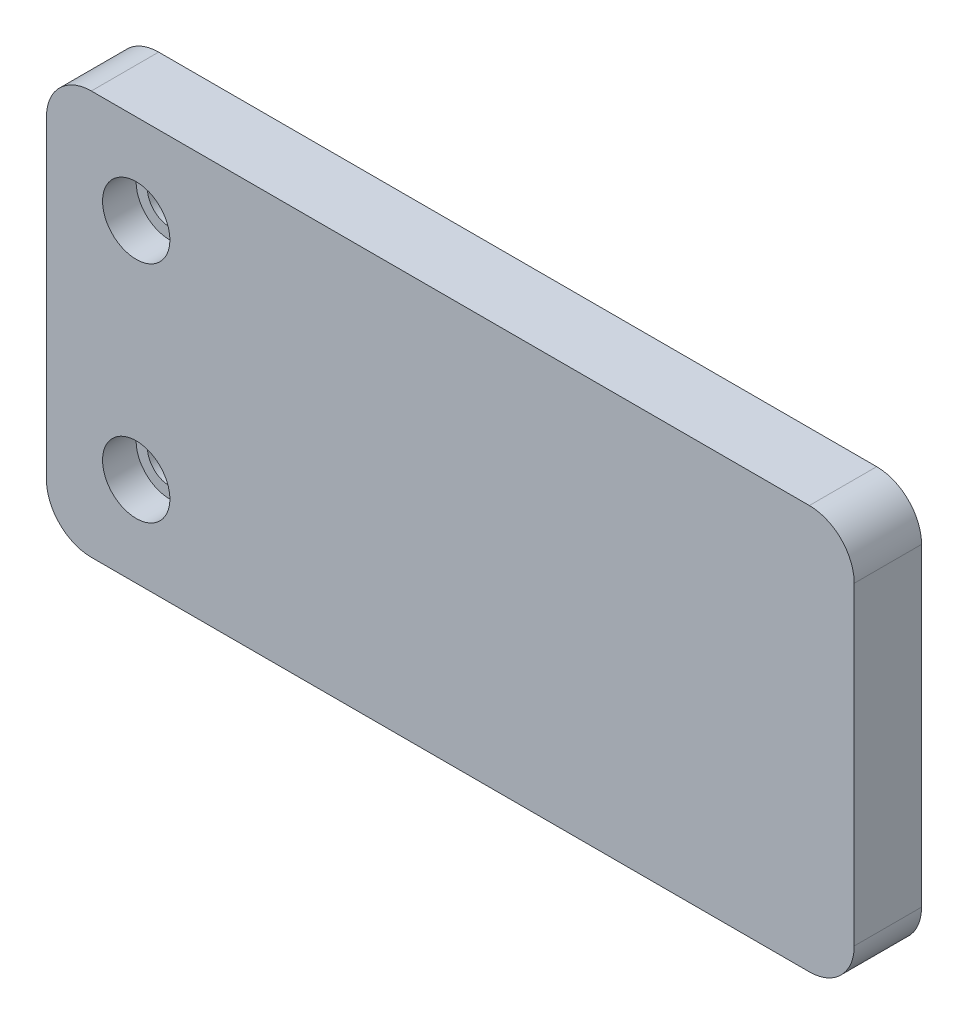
ISO-10303-21;
HEADER;
FILE_DESCRIPTION(('STEP AP214'),'2;1');
FILE_NAME('part.step','',(''),(''),'','','');
FILE_SCHEMA(('AUTOMOTIVE_DESIGN { 1 0 10303 214 1 1 1 1 }'));
ENDSEC;
DATA;
#1=APPLICATION_CONTEXT('core data for automotive mechanical design processes');
#2=APPLICATION_PROTOCOL_DEFINITION('international standard','automotive_design',2000,#1);
#3=PRODUCT_CONTEXT('',#1,'mechanical');
#4=PRODUCT('Part','Part','',(#3));
#5=PRODUCT_RELATED_PRODUCT_CATEGORY('part','',(#4));
#6=PRODUCT_DEFINITION_FORMATION('','',#4);
#7=PRODUCT_DEFINITION_CONTEXT('part definition',#1,'design');
#8=PRODUCT_DEFINITION('design','',#6,#7);
#9=PRODUCT_DEFINITION_SHAPE('','',#8);
#10=(LENGTH_UNIT() NAMED_UNIT(*) SI_UNIT(.MILLI.,.METRE.));
#11=(NAMED_UNIT(*) PLANE_ANGLE_UNIT() SI_UNIT($,.RADIAN.));
#12=(NAMED_UNIT(*) SI_UNIT($,.STERADIAN.) SOLID_ANGLE_UNIT());
#13=UNCERTAINTY_MEASURE_WITH_UNIT(LENGTH_MEASURE(1.E-05),#10,'distance_accuracy_value','');
#14=(GEOMETRIC_REPRESENTATION_CONTEXT(3) GLOBAL_UNCERTAINTY_ASSIGNED_CONTEXT((#13)) GLOBAL_UNIT_ASSIGNED_CONTEXT((#10,
#11,#12)) REPRESENTATION_CONTEXT('',''));
#15=CARTESIAN_POINT('',(0.,0.,0.));
#16=DIRECTION('',(0.,0.,1.));
#17=DIRECTION('',(1.,0.,0.));
#18=AXIS2_PLACEMENT_3D('',#15,#16,#17);
#19=CARTESIAN_POINT('',(0.,0.,9.525));
#20=DIRECTION('',(0.,0.,1.));
#21=DIRECTION('',(1.,0.,0.));
#22=AXIS2_PLACEMENT_3D('',#19,#20,#21);
#23=PLANE('',#22);
#24=CARTESIAN_POINT('',(12.7,44.45,9.525));
#25=DIRECTION('',(0.,0.,1.));
#26=DIRECTION('',(1.,0.,0.));
#27=AXIS2_PLACEMENT_3D('',#24,#25,#26);
#28=CIRCLE('',#27,4.7625);
#29=CARTESIAN_POINT('',(7.93749999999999,44.45,9.525));
#30=VERTEX_POINT('',#29);
#31=EDGE_CURVE('E138',#30,#30,#28,.F.);
#32=ORIENTED_EDGE('',*,*,#31,.T.);
#33=EDGE_LOOP('',(#32));
#34=FACE_BOUND('',#33,.T.);
#35=DIRECTION('',(0.,1.,0.));
#36=VECTOR('',#35,1.);
#37=CARTESIAN_POINT('',(114.3,0.,9.525));
#38=LINE('',#37,#36);
#39=CARTESIAN_POINT('',(114.3,6.35,9.525));
#40=VERTEX_POINT('',#39);
#41=CARTESIAN_POINT('',(114.3,50.8,9.525));
#42=VERTEX_POINT('',#41);
#43=EDGE_CURVE('E185',#40,#42,#38,.T.);
#44=ORIENTED_EDGE('',*,*,#43,.T.);
#45=CARTESIAN_POINT('',(107.95,50.8,9.525));
#46=DIRECTION('',(0.,0.,1.));
#47=DIRECTION('',(1.,0.,0.));
#48=AXIS2_PLACEMENT_3D('',#45,#46,#47);
#49=CIRCLE('',#48,6.35);
#50=CARTESIAN_POINT('',(107.95,57.15,9.525));
#51=VERTEX_POINT('',#50);
#52=EDGE_CURVE('E163',#42,#51,#49,.T.);
#53=ORIENTED_EDGE('',*,*,#52,.T.);
#54=DIRECTION('',(-1.,0.,0.));
#55=VECTOR('',#54,1.);
#56=CARTESIAN_POINT('',(114.3,57.15,9.525));
#57=LINE('',#56,#55);
#58=CARTESIAN_POINT('',(6.34999999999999,57.15,9.525));
#59=VERTEX_POINT('',#58);
#60=EDGE_CURVE('E119',#51,#59,#57,.T.);
#61=ORIENTED_EDGE('',*,*,#60,.T.);
#62=CARTESIAN_POINT('',(6.35,50.8,9.525));
#63=DIRECTION('',(0.,0.,1.));
#64=DIRECTION('',(1.,0.,0.));
#65=AXIS2_PLACEMENT_3D('',#62,#63,#64);
#66=CIRCLE('',#65,6.35);
#67=CARTESIAN_POINT('',(0.,50.8,9.525));
#68=VERTEX_POINT('',#67);
#69=EDGE_CURVE('E158',#59,#68,#66,.T.);
#70=ORIENTED_EDGE('',*,*,#69,.T.);
#71=DIRECTION('',(0.,-1.,0.));
#72=VECTOR('',#71,1.);
#73=CARTESIAN_POINT('',(0.,57.15,9.525));
#74=LINE('',#73,#72);
#75=CARTESIAN_POINT('',(0.,6.35,9.525));
#76=VERTEX_POINT('',#75);
#77=EDGE_CURVE('E126',#68,#76,#74,.T.);
#78=ORIENTED_EDGE('',*,*,#77,.T.);
#79=CARTESIAN_POINT('',(6.35,6.35,9.525));
#80=DIRECTION('',(0.,0.,1.));
#81=DIRECTION('',(1.,0.,0.));
#82=AXIS2_PLACEMENT_3D('',#79,#80,#81);
#83=CIRCLE('',#82,6.35);
#84=CARTESIAN_POINT('',(6.35,0.,9.525));
#85=VERTEX_POINT('',#84);
#86=EDGE_CURVE('E55',#76,#85,#83,.T.);
#87=ORIENTED_EDGE('',*,*,#86,.T.);
#88=DIRECTION('',(1.,0.,0.));
#89=VECTOR('',#88,1.);
#90=CARTESIAN_POINT('',(0.,0.,9.525));
#91=LINE('',#90,#89);
#92=CARTESIAN_POINT('',(107.95,0.,9.525));
#93=VERTEX_POINT('',#92);
#94=EDGE_CURVE('E129',#85,#93,#91,.T.);
#95=ORIENTED_EDGE('',*,*,#94,.T.);
#96=CARTESIAN_POINT('',(107.95,6.35,9.525));
#97=DIRECTION('',(0.,0.,1.));
#98=DIRECTION('',(1.,0.,0.));
#99=AXIS2_PLACEMENT_3D('',#96,#97,#98);
#100=CIRCLE('',#99,6.35);
#101=EDGE_CURVE('E161',#93,#40,#100,.T.);
#102=ORIENTED_EDGE('',*,*,#101,.T.);
#103=EDGE_LOOP('',(#44,#53,#61,#70,#78,#87,#95,#102));
#104=FACE_BOUND('',#103,.T.);
#105=CARTESIAN_POINT('',(12.7,12.7,9.525));
#106=DIRECTION('',(0.,0.,1.));
#107=DIRECTION('',(1.,0.,0.));
#108=AXIS2_PLACEMENT_3D('',#105,#106,#107);
#109=CIRCLE('',#108,4.7625);
#110=CARTESIAN_POINT('',(7.93749999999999,12.7,9.525));
#111=VERTEX_POINT('',#110);
#112=EDGE_CURVE('E146',#111,#111,#109,.F.);
#113=ORIENTED_EDGE('',*,*,#112,.T.);
#114=EDGE_LOOP('',(#113));
#115=FACE_BOUND('',#114,.T.);
#116=ADVANCED_FACE('F33',(#34,#104,#115),#23,.T.);
#117=CARTESIAN_POINT('',(12.7,12.7,9.525));
#118=DIRECTION('',(0.,0.,-1.));
#119=DIRECTION('',(-1.,0.,0.));
#120=AXIS2_PLACEMENT_3D('',#117,#118,#119);
#121=CYLINDRICAL_SURFACE('',#120,3.175);
#122=CARTESIAN_POINT('',(12.7,12.7,0.));
#123=DIRECTION('',(0.,0.,1.));
#124=DIRECTION('',(1.,0.,0.));
#125=AXIS2_PLACEMENT_3D('',#122,#123,#124);
#126=CIRCLE('',#125,3.175);
#127=CARTESIAN_POINT('',(9.52499999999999,12.7,0.));
#128=VERTEX_POINT('',#127);
#129=EDGE_CURVE('E179',#128,#128,#126,.T.);
#130=CARTESIAN_POINT('',(12.7,12.7,4.7752));
#131=DIRECTION('',(0.,0.,1.));
#132=DIRECTION('',(1.,0.,0.));
#133=AXIS2_PLACEMENT_3D('',#130,#131,#132);
#134=CIRCLE('',#133,3.175);
#135=CARTESIAN_POINT('',(9.52499999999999,12.7,4.7752));
#136=VERTEX_POINT('',#135);
#137=EDGE_CURVE('E143',#136,#136,#134,.T.);
#138=CARTESIAN_POINT('',(9.52499999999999,12.7,0.));
#139=CARTESIAN_POINT('',(9.52499999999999,12.7,0.0497416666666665));
#140=CARTESIAN_POINT('',(9.52499999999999,12.7,0.0994833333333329));
#141=CARTESIAN_POINT('',(9.52499999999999,12.7,0.198966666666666));
#142=CARTESIAN_POINT('',(9.52499999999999,12.7,0.248708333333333));
#143=CARTESIAN_POINT('',(9.52499999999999,12.7,0.348191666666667));
#144=CARTESIAN_POINT('',(9.52499999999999,12.7,0.397933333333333));
#145=CARTESIAN_POINT('',(9.52499999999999,12.7,0.497416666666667));
#146=CARTESIAN_POINT('',(9.52499999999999,12.7,0.547158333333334));
#147=CARTESIAN_POINT('',(9.52499999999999,12.7,0.646641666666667));
#148=CARTESIAN_POINT('',(9.52499999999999,12.7,0.696383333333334));
#149=CARTESIAN_POINT('',(9.52499999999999,12.7,0.795866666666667));
#150=CARTESIAN_POINT('',(9.52499999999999,12.7,0.845608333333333));
#151=CARTESIAN_POINT('',(9.52499999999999,12.7,0.945091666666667));
#152=CARTESIAN_POINT('',(9.52499999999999,12.7,0.994833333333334));
#153=CARTESIAN_POINT('',(9.52499999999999,12.7,1.09431666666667));
#154=CARTESIAN_POINT('',(9.52499999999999,12.7,1.14405833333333));
#155=CARTESIAN_POINT('',(9.52499999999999,12.7,1.24354166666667));
#156=CARTESIAN_POINT('',(9.52499999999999,12.7,1.29328333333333));
#157=CARTESIAN_POINT('',(9.52499999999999,12.7,1.39276666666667));
#158=CARTESIAN_POINT('',(9.52499999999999,12.7,1.44250833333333));
#159=CARTESIAN_POINT('',(9.52499999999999,12.7,1.54199166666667));
#160=CARTESIAN_POINT('',(9.52499999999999,12.7,1.59173333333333));
#161=CARTESIAN_POINT('',(9.52499999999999,12.7,1.69121666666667));
#162=CARTESIAN_POINT('',(9.52499999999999,12.7,1.74095833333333));
#163=CARTESIAN_POINT('',(9.52499999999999,12.7,1.84044166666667));
#164=CARTESIAN_POINT('',(9.52499999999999,12.7,1.89018333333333));
#165=CARTESIAN_POINT('',(9.52499999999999,12.7,1.98966666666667));
#166=CARTESIAN_POINT('',(9.52499999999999,12.7,2.03940833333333));
#167=CARTESIAN_POINT('',(9.52499999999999,12.7,2.13889166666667));
#168=CARTESIAN_POINT('',(9.52499999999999,12.7,2.18863333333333));
#169=CARTESIAN_POINT('',(9.52499999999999,12.7,2.28811666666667));
#170=CARTESIAN_POINT('',(9.52499999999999,12.7,2.33785833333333));
#171=CARTESIAN_POINT('',(9.52499999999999,12.7,2.43734166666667));
#172=CARTESIAN_POINT('',(9.52499999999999,12.7,2.48708333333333));
#173=CARTESIAN_POINT('',(9.52499999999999,12.7,2.58656666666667));
#174=CARTESIAN_POINT('',(9.52499999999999,12.7,2.63630833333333));
#175=CARTESIAN_POINT('',(9.52499999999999,12.7,2.73579166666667));
#176=CARTESIAN_POINT('',(9.52499999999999,12.7,2.78553333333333));
#177=CARTESIAN_POINT('',(9.52499999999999,12.7,2.88501666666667));
#178=CARTESIAN_POINT('',(9.52499999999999,12.7,2.93475833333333));
#179=CARTESIAN_POINT('',(9.52499999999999,12.7,3.03424166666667));
#180=CARTESIAN_POINT('',(9.52499999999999,12.7,3.08398333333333));
#181=CARTESIAN_POINT('',(9.52499999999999,12.7,3.18346666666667));
#182=CARTESIAN_POINT('',(9.52499999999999,12.7,3.23320833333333));
#183=CARTESIAN_POINT('',(9.52499999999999,12.7,3.33269166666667));
#184=CARTESIAN_POINT('',(9.52499999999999,12.7,3.38243333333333));
#185=CARTESIAN_POINT('',(9.52499999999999,12.7,3.48191666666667));
#186=CARTESIAN_POINT('',(9.52499999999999,12.7,3.53165833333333));
#187=CARTESIAN_POINT('',(9.52499999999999,12.7,3.63114166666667));
#188=CARTESIAN_POINT('',(9.52499999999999,12.7,3.68088333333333));
#189=CARTESIAN_POINT('',(9.52499999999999,12.7,3.78036666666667));
#190=CARTESIAN_POINT('',(9.52499999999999,12.7,3.83010833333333));
#191=CARTESIAN_POINT('',(9.52499999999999,12.7,3.92959166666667));
#192=CARTESIAN_POINT('',(9.52499999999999,12.7,3.97933333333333));
#193=CARTESIAN_POINT('',(9.52499999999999,12.7,4.07881666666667));
#194=CARTESIAN_POINT('',(9.52499999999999,12.7,4.12855833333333));
#195=CARTESIAN_POINT('',(9.52499999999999,12.7,4.22804166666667));
#196=CARTESIAN_POINT('',(9.52499999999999,12.7,4.27778333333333));
#197=CARTESIAN_POINT('',(9.52499999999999,12.7,4.37726666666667));
#198=CARTESIAN_POINT('',(9.52499999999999,12.7,4.42700833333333));
#199=CARTESIAN_POINT('',(9.52499999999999,12.7,4.52649166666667));
#200=CARTESIAN_POINT('',(9.52499999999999,12.7,4.57623333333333));
#201=CARTESIAN_POINT('',(9.52499999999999,12.7,4.67571666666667));
#202=CARTESIAN_POINT('',(9.52499999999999,12.7,4.72545833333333));
#203=CARTESIAN_POINT('',(9.52499999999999,12.7,4.7752));
#204=B_SPLINE_CURVE_WITH_KNOTS('',3,(#138,#139,#140,#141,#142,#143,#144,#145,#146,#147,#148,
#149,#150,#151,#152,#153,#154,#155,#156,#157,#158,#159,#160,#161,#162,#163,#164,#165,#166,#167,
#168,#169,#170,#171,#172,#173,#174,#175,#176,#177,#178,#179,#180,#181,#182,#183,#184,#185,#186,
#187,#188,#189,#190,#191,#192,#193,#194,#195,#196,#197,#198,#199,#200,#201,#202,#203),
.UNSPECIFIED.,.F.,.F.,(4,2,2,2,2,2,2,2,2,2,2,2,2,2,2,2,2,2,2,2,2,2,2,2,2,2,2,2,2,2,2,2,4),(0.,
0.149224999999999,0.29845,0.447675,0.596900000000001,0.746125,0.89535,1.044575,1.1938,1.343025,
1.49225,1.641475,1.7907,1.939925,2.08915,2.238375,2.3876,2.536825,2.68605,2.835275,2.9845,
3.133725,3.28295,3.432175,3.5814,3.730625,3.87985,4.029075,4.1783,4.327525,4.47675,4.625975,
4.7752),.UNSPECIFIED.);
#205=EDGE_CURVE('BSEAM214',#128,#136,#204,.T.);
#206=ORIENTED_EDGE('',*,*,#129,.F.);
#207=ORIENTED_EDGE('',*,*,#137,.T.);
#208=ORIENTED_EDGE('',*,*,#205,.T.);
#209=ORIENTED_EDGE('',*,*,#205,.F.);
#210=EDGE_LOOP('',(#206,#208,#207,#209));
#211=FACE_BOUND('',#210,.T.);
#212=ADVANCED_FACE('F214',(#211),#121,.F.);
#213=CARTESIAN_POINT('',(12.7,44.45,9.525));
#214=DIRECTION('',(0.,0.,-1.));
#215=DIRECTION('',(-1.,0.,0.));
#216=AXIS2_PLACEMENT_3D('',#213,#214,#215);
#217=CYLINDRICAL_SURFACE('',#216,3.175);
#218=CARTESIAN_POINT('',(12.7,44.45,0.));
#219=DIRECTION('',(0.,0.,1.));
#220=DIRECTION('',(1.,0.,0.));
#221=AXIS2_PLACEMENT_3D('',#218,#219,#220);
#222=CIRCLE('',#221,3.175);
#223=CARTESIAN_POINT('',(9.52499999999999,44.45,0.));
#224=VERTEX_POINT('',#223);
#225=EDGE_CURVE('E142',#224,#224,#222,.T.);
#226=CARTESIAN_POINT('',(12.7,44.45,4.7752));
#227=DIRECTION('',(0.,0.,1.));
#228=DIRECTION('',(1.,0.,0.));
#229=AXIS2_PLACEMENT_3D('',#226,#227,#228);
#230=CIRCLE('',#229,3.175);
#231=CARTESIAN_POINT('',(9.52499999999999,44.45,4.7752));
#232=VERTEX_POINT('',#231);
#233=EDGE_CURVE('E135',#232,#232,#230,.T.);
#234=CARTESIAN_POINT('',(9.52499999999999,44.45,0.));
#235=CARTESIAN_POINT('',(9.52499999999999,44.45,0.0497416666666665));
#236=CARTESIAN_POINT('',(9.52499999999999,44.45,0.0994833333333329));
#237=CARTESIAN_POINT('',(9.52499999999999,44.45,0.198966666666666));
#238=CARTESIAN_POINT('',(9.52499999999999,44.45,0.248708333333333));
#239=CARTESIAN_POINT('',(9.52499999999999,44.45,0.348191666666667));
#240=CARTESIAN_POINT('',(9.52499999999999,44.45,0.397933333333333));
#241=CARTESIAN_POINT('',(9.52499999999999,44.45,0.497416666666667));
#242=CARTESIAN_POINT('',(9.52499999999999,44.45,0.547158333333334));
#243=CARTESIAN_POINT('',(9.52499999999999,44.45,0.646641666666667));
#244=CARTESIAN_POINT('',(9.52499999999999,44.45,0.696383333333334));
#245=CARTESIAN_POINT('',(9.52499999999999,44.45,0.795866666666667));
#246=CARTESIAN_POINT('',(9.52499999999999,44.45,0.845608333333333));
#247=CARTESIAN_POINT('',(9.52499999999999,44.45,0.945091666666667));
#248=CARTESIAN_POINT('',(9.52499999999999,44.45,0.994833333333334));
#249=CARTESIAN_POINT('',(9.52499999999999,44.45,1.09431666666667));
#250=CARTESIAN_POINT('',(9.52499999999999,44.45,1.14405833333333));
#251=CARTESIAN_POINT('',(9.52499999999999,44.45,1.24354166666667));
#252=CARTESIAN_POINT('',(9.52499999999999,44.45,1.29328333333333));
#253=CARTESIAN_POINT('',(9.52499999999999,44.45,1.39276666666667));
#254=CARTESIAN_POINT('',(9.52499999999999,44.45,1.44250833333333));
#255=CARTESIAN_POINT('',(9.52499999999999,44.45,1.54199166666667));
#256=CARTESIAN_POINT('',(9.52499999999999,44.45,1.59173333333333));
#257=CARTESIAN_POINT('',(9.52499999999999,44.45,1.69121666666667));
#258=CARTESIAN_POINT('',(9.52499999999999,44.45,1.74095833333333));
#259=CARTESIAN_POINT('',(9.52499999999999,44.45,1.84044166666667));
#260=CARTESIAN_POINT('',(9.52499999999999,44.45,1.89018333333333));
#261=CARTESIAN_POINT('',(9.52499999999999,44.45,1.98966666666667));
#262=CARTESIAN_POINT('',(9.52499999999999,44.45,2.03940833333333));
#263=CARTESIAN_POINT('',(9.52499999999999,44.45,2.13889166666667));
#264=CARTESIAN_POINT('',(9.52499999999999,44.45,2.18863333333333));
#265=CARTESIAN_POINT('',(9.52499999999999,44.45,2.28811666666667));
#266=CARTESIAN_POINT('',(9.52499999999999,44.45,2.33785833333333));
#267=CARTESIAN_POINT('',(9.52499999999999,44.45,2.43734166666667));
#268=CARTESIAN_POINT('',(9.52499999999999,44.45,2.48708333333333));
#269=CARTESIAN_POINT('',(9.52499999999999,44.45,2.58656666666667));
#270=CARTESIAN_POINT('',(9.52499999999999,44.45,2.63630833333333));
#271=CARTESIAN_POINT('',(9.52499999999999,44.45,2.73579166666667));
#272=CARTESIAN_POINT('',(9.52499999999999,44.45,2.78553333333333));
#273=CARTESIAN_POINT('',(9.52499999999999,44.45,2.88501666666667));
#274=CARTESIAN_POINT('',(9.52499999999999,44.45,2.93475833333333));
#275=CARTESIAN_POINT('',(9.52499999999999,44.45,3.03424166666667));
#276=CARTESIAN_POINT('',(9.52499999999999,44.45,3.08398333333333));
#277=CARTESIAN_POINT('',(9.52499999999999,44.45,3.18346666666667));
#278=CARTESIAN_POINT('',(9.52499999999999,44.45,3.23320833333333));
#279=CARTESIAN_POINT('',(9.52499999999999,44.45,3.33269166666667));
#280=CARTESIAN_POINT('',(9.52499999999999,44.45,3.38243333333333));
#281=CARTESIAN_POINT('',(9.52499999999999,44.45,3.48191666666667));
#282=CARTESIAN_POINT('',(9.52499999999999,44.45,3.53165833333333));
#283=CARTESIAN_POINT('',(9.52499999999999,44.45,3.63114166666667));
#284=CARTESIAN_POINT('',(9.52499999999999,44.45,3.68088333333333));
#285=CARTESIAN_POINT('',(9.52499999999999,44.45,3.78036666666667));
#286=CARTESIAN_POINT('',(9.52499999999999,44.45,3.83010833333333));
#287=CARTESIAN_POINT('',(9.52499999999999,44.45,3.92959166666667));
#288=CARTESIAN_POINT('',(9.52499999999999,44.45,3.97933333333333));
#289=CARTESIAN_POINT('',(9.52499999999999,44.45,4.07881666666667));
#290=CARTESIAN_POINT('',(9.52499999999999,44.45,4.12855833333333));
#291=CARTESIAN_POINT('',(9.52499999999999,44.45,4.22804166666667));
#292=CARTESIAN_POINT('',(9.52499999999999,44.45,4.27778333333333));
#293=CARTESIAN_POINT('',(9.52499999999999,44.45,4.37726666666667));
#294=CARTESIAN_POINT('',(9.52499999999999,44.45,4.42700833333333));
#295=CARTESIAN_POINT('',(9.52499999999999,44.45,4.52649166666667));
#296=CARTESIAN_POINT('',(9.52499999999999,44.45,4.57623333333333));
#297=CARTESIAN_POINT('',(9.52499999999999,44.45,4.67571666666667));
#298=CARTESIAN_POINT('',(9.52499999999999,44.45,4.72545833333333));
#299=CARTESIAN_POINT('',(9.52499999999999,44.45,4.7752));
#300=B_SPLINE_CURVE_WITH_KNOTS('',3,(#234,#235,#236,#237,#238,#239,#240,#241,#242,#243,#244,
#245,#246,#247,#248,#249,#250,#251,#252,#253,#254,#255,#256,#257,#258,#259,#260,#261,#262,#263,
#264,#265,#266,#267,#268,#269,#270,#271,#272,#273,#274,#275,#276,#277,#278,#279,#280,#281,#282,
#283,#284,#285,#286,#287,#288,#289,#290,#291,#292,#293,#294,#295,#296,#297,#298,#299),
.UNSPECIFIED.,.F.,.F.,(4,2,2,2,2,2,2,2,2,2,2,2,2,2,2,2,2,2,2,2,2,2,2,2,2,2,2,2,2,2,2,2,4),(0.,
0.149224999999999,0.29845,0.447675,0.596900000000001,0.746125,0.89535,1.044575,1.1938,1.343025,
1.49225,1.641475,1.7907,1.939925,2.08915,2.238375,2.3876,2.536825,2.68605,2.835275,2.9845,
3.133725,3.28295,3.432175,3.5814,3.730625,3.87985,4.029075,4.1783,4.327525,4.47675,4.625975,
4.7752),.UNSPECIFIED.);
#301=EDGE_CURVE('BSEAM220',#224,#232,#300,.T.);
#302=ORIENTED_EDGE('',*,*,#225,.F.);
#303=ORIENTED_EDGE('',*,*,#233,.T.);
#304=ORIENTED_EDGE('',*,*,#301,.T.);
#305=ORIENTED_EDGE('',*,*,#301,.F.);
#306=EDGE_LOOP('',(#302,#304,#303,#305));
#307=FACE_BOUND('',#306,.T.);
#308=ADVANCED_FACE('F220',(#307),#217,.F.);
#309=CARTESIAN_POINT('',(0.,0.,0.));
#310=DIRECTION('',(0.,0.,1.));
#311=DIRECTION('',(1.,0.,0.));
#312=AXIS2_PLACEMENT_3D('',#309,#310,#311);
#313=PLANE('',#312);
#314=ORIENTED_EDGE('',*,*,#129,.T.);
#315=EDGE_LOOP('',(#314));
#316=FACE_BOUND('',#315,.T.);
#317=DIRECTION('',(-1.,0.,0.));
#318=VECTOR('',#317,1.);
#319=CARTESIAN_POINT('',(114.3,57.15,0.));
#320=LINE('',#319,#318);
#321=CARTESIAN_POINT('',(107.95,57.15,0.));
#322=VERTEX_POINT('',#321);
#323=CARTESIAN_POINT('',(6.34999999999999,57.15,0.));
#324=VERTEX_POINT('',#323);
#325=EDGE_CURVE('E116',#322,#324,#320,.T.);
#326=ORIENTED_EDGE('',*,*,#325,.F.);
#327=CARTESIAN_POINT('',(107.95,50.8,0.));
#328=DIRECTION('',(0.,0.,1.));
#329=DIRECTION('',(1.,0.,0.));
#330=AXIS2_PLACEMENT_3D('',#327,#328,#329);
#331=CIRCLE('',#330,6.35);
#332=CARTESIAN_POINT('',(114.3,50.8,0.));
#333=VERTEX_POINT('',#332);
#334=EDGE_CURVE('E99',#322,#333,#331,.F.);
#335=ORIENTED_EDGE('',*,*,#334,.T.);
#336=DIRECTION('',(0.,1.,0.));
#337=VECTOR('',#336,1.);
#338=CARTESIAN_POINT('',(114.3,0.,0.));
#339=LINE('',#338,#337);
#340=CARTESIAN_POINT('',(114.3,6.35,0.));
#341=VERTEX_POINT('',#340);
#342=EDGE_CURVE('E127',#341,#333,#339,.T.);
#343=ORIENTED_EDGE('',*,*,#342,.F.);
#344=CARTESIAN_POINT('',(107.95,6.35,0.));
#345=DIRECTION('',(0.,0.,1.));
#346=DIRECTION('',(1.,0.,0.));
#347=AXIS2_PLACEMENT_3D('',#344,#345,#346);
#348=CIRCLE('',#347,6.35);
#349=CARTESIAN_POINT('',(107.95,0.,0.));
#350=VERTEX_POINT('',#349);
#351=EDGE_CURVE('E110',#341,#350,#348,.F.);
#352=ORIENTED_EDGE('',*,*,#351,.T.);
#353=DIRECTION('',(1.,0.,0.));
#354=VECTOR('',#353,1.);
#355=CARTESIAN_POINT('',(0.,0.,0.));
#356=LINE('',#355,#354);
#357=CARTESIAN_POINT('',(6.35,0.,0.));
#358=VERTEX_POINT('',#357);
#359=EDGE_CURVE('E131',#358,#350,#356,.T.);
#360=ORIENTED_EDGE('',*,*,#359,.F.);
#361=CARTESIAN_POINT('',(6.35,6.35,0.));
#362=DIRECTION('',(0.,0.,1.));
#363=DIRECTION('',(1.,0.,0.));
#364=AXIS2_PLACEMENT_3D('',#361,#362,#363);
#365=CIRCLE('',#364,6.35);
#366=CARTESIAN_POINT('',(0.,6.35,0.));
#367=VERTEX_POINT('',#366);
#368=EDGE_CURVE('E152',#358,#367,#365,.F.);
#369=ORIENTED_EDGE('',*,*,#368,.T.);
#370=DIRECTION('',(0.,-1.,0.));
#371=VECTOR('',#370,1.);
#372=CARTESIAN_POINT('',(0.,57.15,0.));
#373=LINE('',#372,#371);
#374=CARTESIAN_POINT('',(0.,50.8,0.));
#375=VERTEX_POINT('',#374);
#376=EDGE_CURVE('E174',#375,#367,#373,.T.);
#377=ORIENTED_EDGE('',*,*,#376,.F.);
#378=CARTESIAN_POINT('',(6.35,50.8,0.));
#379=DIRECTION('',(0.,0.,1.));
#380=DIRECTION('',(1.,0.,0.));
#381=AXIS2_PLACEMENT_3D('',#378,#379,#380);
#382=CIRCLE('',#381,6.35);
#383=EDGE_CURVE('E120',#375,#324,#382,.F.);
#384=ORIENTED_EDGE('',*,*,#383,.T.);
#385=EDGE_LOOP('',(#326,#335,#343,#352,#360,#369,#377,#384));
#386=FACE_BOUND('',#385,.T.);
#387=ORIENTED_EDGE('',*,*,#225,.T.);
#388=EDGE_LOOP('',(#387));
#389=FACE_BOUND('',#388,.T.);
#390=ADVANCED_FACE('F123',(#316,#386,#389),#313,.F.);
#391=CARTESIAN_POINT('',(0.,57.15,9.525));
#392=DIRECTION('',(1.,0.,0.));
#393=DIRECTION('',(0.,1.,0.));
#394=AXIS2_PLACEMENT_3D('',#391,#392,#393);
#395=PLANE('',#394);
#396=ORIENTED_EDGE('',*,*,#376,.T.);
#397=DIRECTION('',(0.,0.,-1.));
#398=VECTOR('',#397,1.);
#399=CARTESIAN_POINT('',(0.,6.35,9.525));
#400=LINE('',#399,#398);
#401=EDGE_CURVE('E11',#367,#76,#400,.F.);
#402=ORIENTED_EDGE('',*,*,#401,.T.);
#403=ORIENTED_EDGE('',*,*,#77,.F.);
#404=DIRECTION('',(0.,0.,-1.));
#405=VECTOR('',#404,1.);
#406=CARTESIAN_POINT('',(0.,50.8,9.525));
#407=LINE('',#406,#405);
#408=EDGE_CURVE('E41',#68,#375,#407,.T.);
#409=ORIENTED_EDGE('',*,*,#408,.T.);
#410=EDGE_LOOP('',(#396,#402,#403,#409));
#411=FACE_BOUND('',#410,.T.);
#412=ADVANCED_FACE('F173',(#411),#395,.F.);
#413=CARTESIAN_POINT('',(0.,0.,9.525));
#414=DIRECTION('',(0.,1.,0.));
#415=DIRECTION('',(0.,0.,1.));
#416=AXIS2_PLACEMENT_3D('',#413,#414,#415);
#417=PLANE('',#416);
#418=ORIENTED_EDGE('',*,*,#359,.T.);
#419=DIRECTION('',(0.,0.,-1.));
#420=VECTOR('',#419,1.);
#421=CARTESIAN_POINT('',(107.95,0.,9.525));
#422=LINE('',#421,#420);
#423=EDGE_CURVE('E48',#350,#93,#422,.F.);
#424=ORIENTED_EDGE('',*,*,#423,.T.);
#425=ORIENTED_EDGE('',*,*,#94,.F.);
#426=DIRECTION('',(0.,0.,-1.));
#427=VECTOR('',#426,1.);
#428=CARTESIAN_POINT('',(6.35,0.,9.525));
#429=LINE('',#428,#427);
#430=EDGE_CURVE('E165',#85,#358,#429,.T.);
#431=ORIENTED_EDGE('',*,*,#430,.T.);
#432=EDGE_LOOP('',(#418,#424,#425,#431));
#433=FACE_BOUND('',#432,.T.);
#434=ADVANCED_FACE('F233',(#433),#417,.F.);
#435=CARTESIAN_POINT('',(114.3,0.,9.525));
#436=DIRECTION('',(-1.,0.,0.));
#437=DIRECTION('',(0.,0.,1.));
#438=AXIS2_PLACEMENT_3D('',#435,#436,#437);
#439=PLANE('',#438);
#440=ORIENTED_EDGE('',*,*,#342,.T.);
#441=DIRECTION('',(0.,0.,-1.));
#442=VECTOR('',#441,1.);
#443=CARTESIAN_POINT('',(114.3,50.8,9.525));
#444=LINE('',#443,#442);
#445=EDGE_CURVE('E104',#333,#42,#444,.F.);
#446=ORIENTED_EDGE('',*,*,#445,.T.);
#447=ORIENTED_EDGE('',*,*,#43,.F.);
#448=DIRECTION('',(0.,0.,-1.));
#449=VECTOR('',#448,1.);
#450=CARTESIAN_POINT('',(114.3,6.35,9.525));
#451=LINE('',#450,#449);
#452=EDGE_CURVE('E109',#40,#341,#451,.T.);
#453=ORIENTED_EDGE('',*,*,#452,.T.);
#454=EDGE_LOOP('',(#440,#446,#447,#453));
#455=FACE_BOUND('',#454,.T.);
#456=ADVANCED_FACE('F230',(#455),#439,.F.);
#457=CARTESIAN_POINT('',(114.3,57.15,9.525));
#458=DIRECTION('',(0.,-1.,0.));
#459=DIRECTION('',(1.,0.,0.));
#460=AXIS2_PLACEMENT_3D('',#457,#458,#459);
#461=PLANE('',#460);
#462=ORIENTED_EDGE('',*,*,#60,.F.);
#463=DIRECTION('',(0.,0.,-1.));
#464=VECTOR('',#463,1.);
#465=CARTESIAN_POINT('',(107.95,57.15,9.525));
#466=LINE('',#465,#464);
#467=EDGE_CURVE('E103',#51,#322,#466,.T.);
#468=ORIENTED_EDGE('',*,*,#467,.T.);
#469=ORIENTED_EDGE('',*,*,#325,.T.);
#470=DIRECTION('',(0.,0.,-1.));
#471=VECTOR('',#470,1.);
#472=CARTESIAN_POINT('',(6.34999999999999,57.15,9.525));
#473=LINE('',#472,#471);
#474=EDGE_CURVE('E121',#324,#59,#473,.F.);
#475=ORIENTED_EDGE('',*,*,#474,.T.);
#476=EDGE_LOOP('',(#462,#468,#469,#475));
#477=FACE_BOUND('',#476,.T.);
#478=ADVANCED_FACE('F115',(#477),#461,.F.);
#479=CARTESIAN_POINT('',(12.7,44.45,14.3002));
#480=DIRECTION('',(0.,0.,-1.));
#481=DIRECTION('',(-1.,0.,0.));
#482=AXIS2_PLACEMENT_3D('',#479,#480,#481);
#483=CYLINDRICAL_SURFACE('',#482,4.7625);
#484=CARTESIAN_POINT('',(12.7,44.45,4.7752));
#485=DIRECTION('',(0.,0.,1.));
#486=DIRECTION('',(1.,0.,0.));
#487=AXIS2_PLACEMENT_3D('',#484,#485,#486);
#488=CIRCLE('',#487,4.7625);
#489=CARTESIAN_POINT('',(7.93749999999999,44.45,4.7752));
#490=VERTEX_POINT('',#489);
#491=EDGE_CURVE('E139',#490,#490,#488,.T.);
#492=CARTESIAN_POINT('',(7.93749999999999,44.45,9.525));
#493=CARTESIAN_POINT('',(7.93749999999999,44.45,9.47552291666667));
#494=CARTESIAN_POINT('',(7.93749999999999,44.45,9.42604583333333));
#495=CARTESIAN_POINT('',(7.93749999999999,44.45,9.32709166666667));
#496=CARTESIAN_POINT('',(7.93749999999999,44.45,9.27761458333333));
#497=CARTESIAN_POINT('',(7.93749999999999,44.45,9.17866041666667));
#498=CARTESIAN_POINT('',(7.93749999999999,44.45,9.12918333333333));
#499=CARTESIAN_POINT('',(7.93749999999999,44.45,9.03022916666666));
#500=CARTESIAN_POINT('',(7.93749999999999,44.45,8.98075208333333));
#501=CARTESIAN_POINT('',(7.93749999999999,44.45,8.88179791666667));
#502=CARTESIAN_POINT('',(7.93749999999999,44.45,8.83232083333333));
#503=CARTESIAN_POINT('',(7.93749999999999,44.45,8.73336666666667));
#504=CARTESIAN_POINT('',(7.93749999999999,44.45,8.68388958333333));
#505=CARTESIAN_POINT('',(7.93749999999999,44.45,8.58493541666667));
#506=CARTESIAN_POINT('',(7.93749999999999,44.45,8.53545833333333));
#507=CARTESIAN_POINT('',(7.93749999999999,44.45,8.43650416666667));
#508=CARTESIAN_POINT('',(7.93749999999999,44.45,8.38702708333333));
#509=CARTESIAN_POINT('',(7.93749999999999,44.45,8.28807291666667));
#510=CARTESIAN_POINT('',(7.93749999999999,44.45,8.23859583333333));
#511=CARTESIAN_POINT('',(7.93749999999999,44.45,8.13964166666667));
#512=CARTESIAN_POINT('',(7.93749999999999,44.45,8.09016458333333));
#513=CARTESIAN_POINT('',(7.93749999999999,44.45,7.99121041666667));
#514=CARTESIAN_POINT('',(7.93749999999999,44.45,7.94173333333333));
#515=CARTESIAN_POINT('',(7.93749999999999,44.45,7.84277916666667));
#516=CARTESIAN_POINT('',(7.93749999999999,44.45,7.79330208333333));
#517=CARTESIAN_POINT('',(7.93749999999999,44.45,7.69434791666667));
#518=CARTESIAN_POINT('',(7.93749999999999,44.45,7.64487083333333));
#519=CARTESIAN_POINT('',(7.93749999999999,44.45,7.54591666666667));
#520=CARTESIAN_POINT('',(7.93749999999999,44.45,7.49643958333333));
#521=CARTESIAN_POINT('',(7.93749999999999,44.45,7.39748541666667));
#522=CARTESIAN_POINT('',(7.93749999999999,44.45,7.34800833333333));
#523=CARTESIAN_POINT('',(7.93749999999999,44.45,7.24905416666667));
#524=CARTESIAN_POINT('',(7.93749999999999,44.45,7.19957708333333));
#525=CARTESIAN_POINT('',(7.93749999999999,44.45,7.10062291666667));
#526=CARTESIAN_POINT('',(7.93749999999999,44.45,7.05114583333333));
#527=CARTESIAN_POINT('',(7.93749999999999,44.45,6.95219166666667));
#528=CARTESIAN_POINT('',(7.93749999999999,44.45,6.90271458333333));
#529=CARTESIAN_POINT('',(7.93749999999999,44.45,6.80376041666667));
#530=CARTESIAN_POINT('',(7.93749999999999,44.45,6.75428333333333));
#531=CARTESIAN_POINT('',(7.93749999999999,44.45,6.65532916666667));
#532=CARTESIAN_POINT('',(7.93749999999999,44.45,6.60585208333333));
#533=CARTESIAN_POINT('',(7.93749999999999,44.45,6.50689791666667));
#534=CARTESIAN_POINT('',(7.93749999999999,44.45,6.45742083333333));
#535=CARTESIAN_POINT('',(7.93749999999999,44.45,6.35846666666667));
#536=CARTESIAN_POINT('',(7.93749999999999,44.45,6.30898958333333));
#537=CARTESIAN_POINT('',(7.93749999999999,44.45,6.21003541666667));
#538=CARTESIAN_POINT('',(7.93749999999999,44.45,6.16055833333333));
#539=CARTESIAN_POINT('',(7.93749999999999,44.45,6.06160416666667));
#540=CARTESIAN_POINT('',(7.93749999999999,44.45,6.01212708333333));
#541=CARTESIAN_POINT('',(7.93749999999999,44.45,5.91317291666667));
#542=CARTESIAN_POINT('',(7.93749999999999,44.45,5.86369583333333));
#543=CARTESIAN_POINT('',(7.93749999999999,44.45,5.76474166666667));
#544=CARTESIAN_POINT('',(7.93749999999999,44.45,5.71526458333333));
#545=CARTESIAN_POINT('',(7.93749999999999,44.45,5.61631041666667));
#546=CARTESIAN_POINT('',(7.93749999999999,44.45,5.56683333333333));
#547=CARTESIAN_POINT('',(7.93749999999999,44.45,5.46787916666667));
#548=CARTESIAN_POINT('',(7.93749999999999,44.45,5.41840208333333));
#549=CARTESIAN_POINT('',(7.93749999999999,44.45,5.31944791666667));
#550=CARTESIAN_POINT('',(7.93749999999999,44.45,5.26997083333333));
#551=CARTESIAN_POINT('',(7.93749999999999,44.45,5.17101666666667));
#552=CARTESIAN_POINT('',(7.93749999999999,44.45,5.12153958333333));
#553=CARTESIAN_POINT('',(7.93749999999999,44.45,5.02258541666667));
#554=CARTESIAN_POINT('',(7.93749999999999,44.45,4.97310833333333));
#555=CARTESIAN_POINT('',(7.93749999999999,44.45,4.87415416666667));
#556=CARTESIAN_POINT('',(7.93749999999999,44.45,4.82467708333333));
#557=CARTESIAN_POINT('',(7.93749999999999,44.45,4.7752));
#558=B_SPLINE_CURVE_WITH_KNOTS('',3,(#492,#493,#494,#495,#496,#497,#498,#499,#500,#501,#502,
#503,#504,#505,#506,#507,#508,#509,#510,#511,#512,#513,#514,#515,#516,#517,#518,#519,#520,#521,
#522,#523,#524,#525,#526,#527,#528,#529,#530,#531,#532,#533,#534,#535,#536,#537,#538,#539,#540,
#541,#542,#543,#544,#545,#546,#547,#548,#549,#550,#551,#552,#553,#554,#555,#556,#557),
.UNSPECIFIED.,.F.,.F.,(4,2,2,2,2,2,2,2,2,2,2,2,2,2,2,2,2,2,2,2,2,2,2,2,2,2,2,2,2,2,2,2,4),(0.,
0.148431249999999,0.296862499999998,0.445293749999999,0.593725,0.742156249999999,
0.890587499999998,1.03901875,1.18745,1.33588125,1.4843125,1.63274375,1.781175,1.92960625,
2.0780375,2.22646875,2.3749,2.52333125,2.6717625,2.82019375,2.968625,3.11705625,3.2654875,
3.41391875,3.56235,3.71078125,3.8592125,4.00764375,4.156075,4.30450625,4.4529375,4.60136875,
4.7498),.UNSPECIFIED.);
#559=EDGE_CURVE('BSEAM209',#30,#490,#558,.T.);
#560=ORIENTED_EDGE('',*,*,#31,.F.);
#561=ORIENTED_EDGE('',*,*,#491,.F.);
#562=ORIENTED_EDGE('',*,*,#559,.T.);
#563=ORIENTED_EDGE('',*,*,#559,.F.);
#564=EDGE_LOOP('',(#560,#562,#561,#563));
#565=FACE_BOUND('',#564,.T.);
#566=ADVANCED_FACE('F209',(#565),#483,.F.);
#567=CARTESIAN_POINT('',(12.7,44.45,4.7752));
#568=DIRECTION('',(0.,0.,1.));
#569=DIRECTION('',(1.,0.,0.));
#570=AXIS2_PLACEMENT_3D('',#567,#568,#569);
#571=PLANE('',#570);
#572=ORIENTED_EDGE('',*,*,#233,.F.);
#573=EDGE_LOOP('',(#572));
#574=FACE_BOUND('',#573,.T.);
#575=ORIENTED_EDGE('',*,*,#491,.T.);
#576=EDGE_LOOP('',(#575));
#577=FACE_BOUND('',#576,.T.);
#578=ADVANCED_FACE('F200',(#574,#577),#571,.T.);
#579=CARTESIAN_POINT('',(12.7,12.7,14.3002));
#580=DIRECTION('',(0.,0.,-1.));
#581=DIRECTION('',(-1.,0.,0.));
#582=AXIS2_PLACEMENT_3D('',#579,#580,#581);
#583=CYLINDRICAL_SURFACE('',#582,4.7625);
#584=CARTESIAN_POINT('',(12.7,12.7,4.7752));
#585=DIRECTION('',(0.,0.,1.));
#586=DIRECTION('',(1.,0.,0.));
#587=AXIS2_PLACEMENT_3D('',#584,#585,#586);
#588=CIRCLE('',#587,4.7625);
#589=CARTESIAN_POINT('',(7.93749999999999,12.7,4.7752));
#590=VERTEX_POINT('',#589);
#591=EDGE_CURVE('E147',#590,#590,#588,.T.);
#592=CARTESIAN_POINT('',(7.93749999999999,12.7,9.525));
#593=CARTESIAN_POINT('',(7.93749999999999,12.7,9.47552291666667));
#594=CARTESIAN_POINT('',(7.93749999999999,12.7,9.42604583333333));
#595=CARTESIAN_POINT('',(7.93749999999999,12.7,9.32709166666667));
#596=CARTESIAN_POINT('',(7.93749999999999,12.7,9.27761458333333));
#597=CARTESIAN_POINT('',(7.93749999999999,12.7,9.17866041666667));
#598=CARTESIAN_POINT('',(7.93749999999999,12.7,9.12918333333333));
#599=CARTESIAN_POINT('',(7.93749999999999,12.7,9.03022916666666));
#600=CARTESIAN_POINT('',(7.93749999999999,12.7,8.98075208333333));
#601=CARTESIAN_POINT('',(7.93749999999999,12.7,8.88179791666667));
#602=CARTESIAN_POINT('',(7.93749999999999,12.7,8.83232083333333));
#603=CARTESIAN_POINT('',(7.93749999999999,12.7,8.73336666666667));
#604=CARTESIAN_POINT('',(7.93749999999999,12.7,8.68388958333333));
#605=CARTESIAN_POINT('',(7.93749999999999,12.7,8.58493541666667));
#606=CARTESIAN_POINT('',(7.93749999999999,12.7,8.53545833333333));
#607=CARTESIAN_POINT('',(7.93749999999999,12.7,8.43650416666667));
#608=CARTESIAN_POINT('',(7.93749999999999,12.7,8.38702708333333));
#609=CARTESIAN_POINT('',(7.93749999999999,12.7,8.28807291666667));
#610=CARTESIAN_POINT('',(7.93749999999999,12.7,8.23859583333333));
#611=CARTESIAN_POINT('',(7.93749999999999,12.7,8.13964166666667));
#612=CARTESIAN_POINT('',(7.93749999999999,12.7,8.09016458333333));
#613=CARTESIAN_POINT('',(7.93749999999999,12.7,7.99121041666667));
#614=CARTESIAN_POINT('',(7.93749999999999,12.7,7.94173333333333));
#615=CARTESIAN_POINT('',(7.93749999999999,12.7,7.84277916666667));
#616=CARTESIAN_POINT('',(7.93749999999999,12.7,7.79330208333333));
#617=CARTESIAN_POINT('',(7.93749999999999,12.7,7.69434791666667));
#618=CARTESIAN_POINT('',(7.93749999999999,12.7,7.64487083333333));
#619=CARTESIAN_POINT('',(7.93749999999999,12.7,7.54591666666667));
#620=CARTESIAN_POINT('',(7.93749999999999,12.7,7.49643958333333));
#621=CARTESIAN_POINT('',(7.93749999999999,12.7,7.39748541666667));
#622=CARTESIAN_POINT('',(7.93749999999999,12.7,7.34800833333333));
#623=CARTESIAN_POINT('',(7.93749999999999,12.7,7.24905416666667));
#624=CARTESIAN_POINT('',(7.93749999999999,12.7,7.19957708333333));
#625=CARTESIAN_POINT('',(7.93749999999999,12.7,7.10062291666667));
#626=CARTESIAN_POINT('',(7.93749999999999,12.7,7.05114583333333));
#627=CARTESIAN_POINT('',(7.93749999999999,12.7,6.95219166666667));
#628=CARTESIAN_POINT('',(7.93749999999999,12.7,6.90271458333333));
#629=CARTESIAN_POINT('',(7.93749999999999,12.7,6.80376041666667));
#630=CARTESIAN_POINT('',(7.93749999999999,12.7,6.75428333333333));
#631=CARTESIAN_POINT('',(7.93749999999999,12.7,6.65532916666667));
#632=CARTESIAN_POINT('',(7.93749999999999,12.7,6.60585208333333));
#633=CARTESIAN_POINT('',(7.93749999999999,12.7,6.50689791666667));
#634=CARTESIAN_POINT('',(7.93749999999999,12.7,6.45742083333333));
#635=CARTESIAN_POINT('',(7.93749999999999,12.7,6.35846666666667));
#636=CARTESIAN_POINT('',(7.93749999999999,12.7,6.30898958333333));
#637=CARTESIAN_POINT('',(7.93749999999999,12.7,6.21003541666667));
#638=CARTESIAN_POINT('',(7.93749999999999,12.7,6.16055833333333));
#639=CARTESIAN_POINT('',(7.93749999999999,12.7,6.06160416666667));
#640=CARTESIAN_POINT('',(7.93749999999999,12.7,6.01212708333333));
#641=CARTESIAN_POINT('',(7.93749999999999,12.7,5.91317291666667));
#642=CARTESIAN_POINT('',(7.93749999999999,12.7,5.86369583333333));
#643=CARTESIAN_POINT('',(7.93749999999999,12.7,5.76474166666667));
#644=CARTESIAN_POINT('',(7.93749999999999,12.7,5.71526458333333));
#645=CARTESIAN_POINT('',(7.93749999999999,12.7,5.61631041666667));
#646=CARTESIAN_POINT('',(7.93749999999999,12.7,5.56683333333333));
#647=CARTESIAN_POINT('',(7.93749999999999,12.7,5.46787916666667));
#648=CARTESIAN_POINT('',(7.93749999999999,12.7,5.41840208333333));
#649=CARTESIAN_POINT('',(7.93749999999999,12.7,5.31944791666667));
#650=CARTESIAN_POINT('',(7.93749999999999,12.7,5.26997083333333));
#651=CARTESIAN_POINT('',(7.93749999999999,12.7,5.17101666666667));
#652=CARTESIAN_POINT('',(7.93749999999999,12.7,5.12153958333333));
#653=CARTESIAN_POINT('',(7.93749999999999,12.7,5.02258541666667));
#654=CARTESIAN_POINT('',(7.93749999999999,12.7,4.97310833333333));
#655=CARTESIAN_POINT('',(7.93749999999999,12.7,4.87415416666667));
#656=CARTESIAN_POINT('',(7.93749999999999,12.7,4.82467708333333));
#657=CARTESIAN_POINT('',(7.93749999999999,12.7,4.7752));
#658=B_SPLINE_CURVE_WITH_KNOTS('',3,(#592,#593,#594,#595,#596,#597,#598,#599,#600,#601,#602,
#603,#604,#605,#606,#607,#608,#609,#610,#611,#612,#613,#614,#615,#616,#617,#618,#619,#620,#621,
#622,#623,#624,#625,#626,#627,#628,#629,#630,#631,#632,#633,#634,#635,#636,#637,#638,#639,#640,
#641,#642,#643,#644,#645,#646,#647,#648,#649,#650,#651,#652,#653,#654,#655,#656,#657),
.UNSPECIFIED.,.F.,.F.,(4,2,2,2,2,2,2,2,2,2,2,2,2,2,2,2,2,2,2,2,2,2,2,2,2,2,2,2,2,2,2,2,4),(0.,
0.148431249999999,0.296862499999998,0.445293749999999,0.593725,0.742156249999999,
0.890587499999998,1.03901875,1.18745,1.33588125,1.4843125,1.63274375,1.781175,1.92960625,
2.0780375,2.22646875,2.3749,2.52333125,2.6717625,2.82019375,2.968625,3.11705625,3.2654875,
3.41391875,3.56235,3.71078125,3.8592125,4.00764375,4.156075,4.30450625,4.4529375,4.60136875,
4.7498),.UNSPECIFIED.);
#659=EDGE_CURVE('BSEAM198',#111,#590,#658,.T.);
#660=ORIENTED_EDGE('',*,*,#112,.F.);
#661=ORIENTED_EDGE('',*,*,#591,.F.);
#662=ORIENTED_EDGE('',*,*,#659,.T.);
#663=ORIENTED_EDGE('',*,*,#659,.F.);
#664=EDGE_LOOP('',(#660,#662,#661,#663));
#665=FACE_BOUND('',#664,.T.);
#666=ADVANCED_FACE('F198',(#665),#583,.F.);
#667=CARTESIAN_POINT('',(12.7,12.7,4.7752));
#668=DIRECTION('',(0.,0.,1.));
#669=DIRECTION('',(1.,0.,0.));
#670=AXIS2_PLACEMENT_3D('',#667,#668,#669);
#671=PLANE('',#670);
#672=ORIENTED_EDGE('',*,*,#137,.F.);
#673=EDGE_LOOP('',(#672));
#674=FACE_BOUND('',#673,.T.);
#675=ORIENTED_EDGE('',*,*,#591,.T.);
#676=EDGE_LOOP('',(#675));
#677=FACE_BOUND('',#676,.T.);
#678=ADVANCED_FACE('F196',(#674,#677),#671,.T.);
#679=CARTESIAN_POINT('',(107.95,50.8,9.525));
#680=DIRECTION('',(0.,0.,-1.));
#681=DIRECTION('',(-1.,0.,0.));
#682=AXIS2_PLACEMENT_3D('',#679,#680,#681);
#683=CYLINDRICAL_SURFACE('',#682,6.35);
#684=ORIENTED_EDGE('',*,*,#52,.F.);
#685=ORIENTED_EDGE('',*,*,#445,.F.);
#686=ORIENTED_EDGE('',*,*,#334,.F.);
#687=ORIENTED_EDGE('',*,*,#467,.F.);
#688=EDGE_LOOP('',(#684,#685,#686,#687));
#689=FACE_BOUND('',#688,.T.);
#690=ADVANCED_FACE('F102',(#689),#683,.T.);
#691=CARTESIAN_POINT('',(107.95,6.35,9.525));
#692=DIRECTION('',(0.,0.,-1.));
#693=DIRECTION('',(-1.,0.,0.));
#694=AXIS2_PLACEMENT_3D('',#691,#692,#693);
#695=CYLINDRICAL_SURFACE('',#694,6.35);
#696=ORIENTED_EDGE('',*,*,#101,.F.);
#697=ORIENTED_EDGE('',*,*,#423,.F.);
#698=ORIENTED_EDGE('',*,*,#351,.F.);
#699=ORIENTED_EDGE('',*,*,#452,.F.);
#700=EDGE_LOOP('',(#696,#697,#698,#699));
#701=FACE_BOUND('',#700,.T.);
#702=ADVANCED_FACE('F241',(#701),#695,.T.);
#703=CARTESIAN_POINT('',(6.35,6.35,9.525));
#704=DIRECTION('',(0.,0.,-1.));
#705=DIRECTION('',(-1.,0.,0.));
#706=AXIS2_PLACEMENT_3D('',#703,#704,#705);
#707=CYLINDRICAL_SURFACE('',#706,6.35);
#708=ORIENTED_EDGE('',*,*,#86,.F.);
#709=ORIENTED_EDGE('',*,*,#401,.F.);
#710=ORIENTED_EDGE('',*,*,#368,.F.);
#711=ORIENTED_EDGE('',*,*,#430,.F.);
#712=EDGE_LOOP('',(#708,#709,#710,#711));
#713=FACE_BOUND('',#712,.T.);
#714=ADVANCED_FACE('F243',(#713),#707,.T.);
#715=CARTESIAN_POINT('',(6.35,50.8,9.525));
#716=DIRECTION('',(0.,0.,-1.));
#717=DIRECTION('',(-1.,0.,0.));
#718=AXIS2_PLACEMENT_3D('',#715,#716,#717);
#719=CYLINDRICAL_SURFACE('',#718,6.35);
#720=ORIENTED_EDGE('',*,*,#69,.F.);
#721=ORIENTED_EDGE('',*,*,#474,.F.);
#722=ORIENTED_EDGE('',*,*,#383,.F.);
#723=ORIENTED_EDGE('',*,*,#408,.F.);
#724=EDGE_LOOP('',(#720,#721,#722,#723));
#725=FACE_BOUND('',#724,.T.);
#726=ADVANCED_FACE('F35',(#725),#719,.T.);
#727=CLOSED_SHELL('',(#116,#212,#308,#390,#412,#434,#456,#478,#566,#578,#666,#678,#690,#702,
#714,#726));
#728=MANIFOLD_SOLID_BREP('B2',#727);
#729=ADVANCED_BREP_SHAPE_REPRESENTATION('',(#18,#728),#14);
#730=SHAPE_DEFINITION_REPRESENTATION(#9,#729);
ENDSEC;
END-ISO-10303-21;
